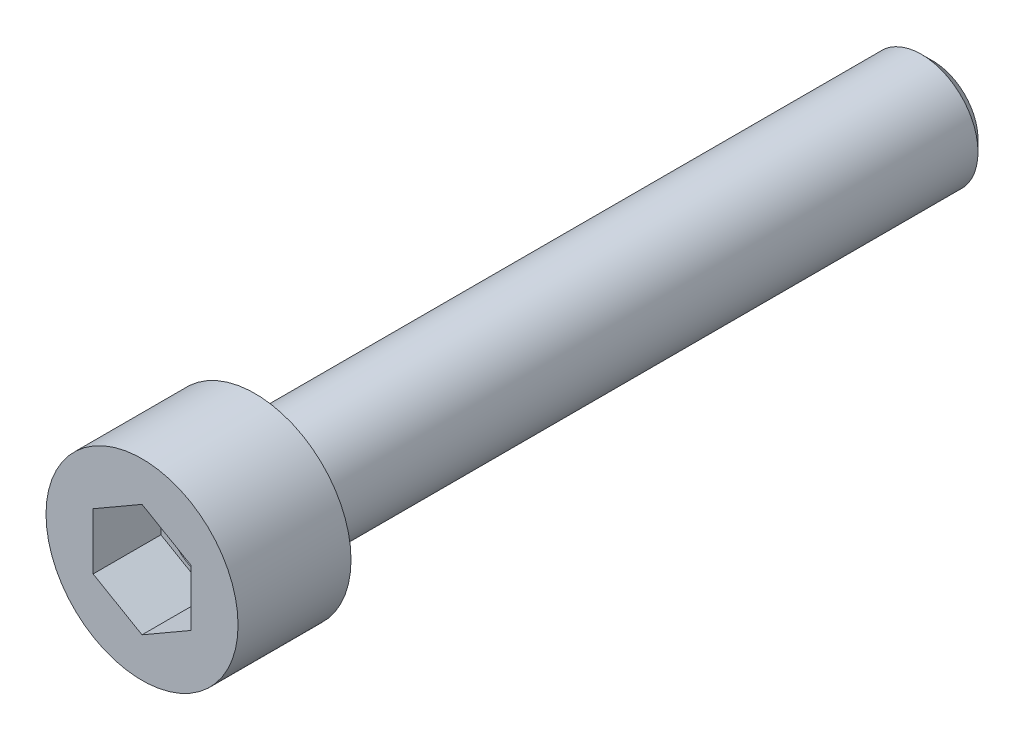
ISO-10303-21;
HEADER;
FILE_DESCRIPTION(('STEP AP214'),'2;1');
FILE_NAME('part.step','',(''),(''),'','','');
FILE_SCHEMA(('AUTOMOTIVE_DESIGN { 1 0 10303 214 1 1 1 1 }'));
ENDSEC;
DATA;
#1=APPLICATION_CONTEXT('core data for automotive mechanical design processes');
#2=APPLICATION_PROTOCOL_DEFINITION('international standard','automotive_design',2000,#1);
#3=PRODUCT_CONTEXT('',#1,'mechanical');
#4=PRODUCT('Part','Part','',(#3));
#5=PRODUCT_RELATED_PRODUCT_CATEGORY('part','',(#4));
#6=PRODUCT_DEFINITION_FORMATION('','',#4);
#7=PRODUCT_DEFINITION_CONTEXT('part definition',#1,'design');
#8=PRODUCT_DEFINITION('design','',#6,#7);
#9=PRODUCT_DEFINITION_SHAPE('','',#8);
#10=(LENGTH_UNIT() NAMED_UNIT(*) SI_UNIT(.MILLI.,.METRE.));
#11=(NAMED_UNIT(*) PLANE_ANGLE_UNIT() SI_UNIT($,.RADIAN.));
#12=(NAMED_UNIT(*) SI_UNIT($,.STERADIAN.) SOLID_ANGLE_UNIT());
#13=UNCERTAINTY_MEASURE_WITH_UNIT(LENGTH_MEASURE(1.E-05),#10,'distance_accuracy_value','');
#14=(GEOMETRIC_REPRESENTATION_CONTEXT(3) GLOBAL_UNCERTAINTY_ASSIGNED_CONTEXT((#13)) GLOBAL_UNIT_ASSIGNED_CONTEXT((#10,
#11,#12)) REPRESENTATION_CONTEXT('',''));
#15=CARTESIAN_POINT('',(0.,0.,0.));
#16=DIRECTION('',(0.,0.,1.));
#17=DIRECTION('',(1.,0.,0.));
#18=AXIS2_PLACEMENT_3D('',#15,#16,#17);
#19=CARTESIAN_POINT('',(0.,0.,-5.));
#20=DIRECTION('',(0.,0.,1.));
#21=DIRECTION('',(1.,0.,0.));
#22=AXIS2_PLACEMENT_3D('',#19,#20,#21);
#23=PLANE('',#22);
#24=CARTESIAN_POINT('',(0.,0.,-5.));
#25=DIRECTION('',(0.,0.,1.));
#26=DIRECTION('',(1.,0.,0.));
#27=AXIS2_PLACEMENT_3D('',#24,#25,#26);
#28=CIRCLE('',#27,4.25);
#29=CARTESIAN_POINT('',(4.25,0.,-5.));
#30=VERTEX_POINT('',#29);
#31=EDGE_CURVE('E147',#30,#30,#28,.T.);
#32=ORIENTED_EDGE('',*,*,#31,.F.);
#33=EDGE_LOOP('',(#32));
#34=FACE_BOUND('',#33,.T.);
#35=CARTESIAN_POINT('',(0.,0.,-5.));
#36=DIRECTION('',(0.,0.,1.));
#37=DIRECTION('',(1.,0.,0.));
#38=AXIS2_PLACEMENT_3D('',#35,#36,#37);
#39=CIRCLE('',#38,2.5);
#40=CARTESIAN_POINT('',(2.5,0.,-5.));
#41=VERTEX_POINT('',#40);
#42=EDGE_CURVE('E150',#41,#41,#39,.F.);
#43=ORIENTED_EDGE('',*,*,#42,.F.);
#44=EDGE_LOOP('',(#43));
#45=FACE_BOUND('',#44,.T.);
#46=ADVANCED_FACE('F28',(#34,#45),#23,.F.);
#47=CARTESIAN_POINT('',(0.,0.,-5.));
#48=DIRECTION('',(0.,0.,1.));
#49=DIRECTION('',(1.,0.,0.));
#50=AXIS2_PLACEMENT_3D('',#47,#48,#49);
#51=CYLINDRICAL_SURFACE('',#50,4.25);
#52=ORIENTED_EDGE('',*,*,#31,.T.);
#53=EDGE_LOOP('',(#52));
#54=FACE_BOUND('',#53,.T.);
#55=CARTESIAN_POINT('',(0.,0.,0.));
#56=DIRECTION('',(0.,0.,1.));
#57=DIRECTION('',(1.,0.,0.));
#58=AXIS2_PLACEMENT_3D('',#55,#56,#57);
#59=CIRCLE('',#58,4.25);
#60=CARTESIAN_POINT('',(4.25,0.,0.));
#61=VERTEX_POINT('',#60);
#62=EDGE_CURVE('E135',#61,#61,#59,.T.);
#63=ORIENTED_EDGE('',*,*,#62,.F.);
#64=EDGE_LOOP('',(#63));
#65=FACE_BOUND('',#64,.T.);
#66=ADVANCED_FACE('F30',(#54,#65),#51,.T.);
#67=CARTESIAN_POINT('',(0.,0.,0.));
#68=DIRECTION('',(0.,0.,1.));
#69=DIRECTION('',(1.,0.,0.));
#70=AXIS2_PLACEMENT_3D('',#67,#68,#69);
#71=PLANE('',#70);
#72=DIRECTION('',(0.866025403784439,-0.5,0.));
#73=VECTOR('',#72,1.);
#74=CARTESIAN_POINT('',(-2.1650635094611,-1.25,0.));
#75=LINE('',#74,#73);
#76=CARTESIAN_POINT('',(-2.1650635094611,-1.25,0.));
#77=VERTEX_POINT('',#76);
#78=CARTESIAN_POINT('',(0.,-2.5,0.));
#79=VERTEX_POINT('',#78);
#80=EDGE_CURVE('E43',#77,#79,#75,.T.);
#81=ORIENTED_EDGE('',*,*,#80,.F.);
#82=DIRECTION('',(0.,-1.,0.));
#83=VECTOR('',#82,1.);
#84=CARTESIAN_POINT('',(-2.1650635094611,1.25,0.));
#85=LINE('',#84,#83);
#86=CARTESIAN_POINT('',(-2.1650635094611,1.25,0.));
#87=VERTEX_POINT('',#86);
#88=EDGE_CURVE('E113',#87,#77,#85,.T.);
#89=ORIENTED_EDGE('',*,*,#88,.F.);
#90=DIRECTION('',(-0.866025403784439,-0.5,0.));
#91=VECTOR('',#90,1.);
#92=CARTESIAN_POINT('',(0.,2.5,0.));
#93=LINE('',#92,#91);
#94=CARTESIAN_POINT('',(0.,2.5,0.));
#95=VERTEX_POINT('',#94);
#96=EDGE_CURVE('E110',#95,#87,#93,.T.);
#97=ORIENTED_EDGE('',*,*,#96,.F.);
#98=DIRECTION('',(-0.866025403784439,0.5,0.));
#99=VECTOR('',#98,1.);
#100=CARTESIAN_POINT('',(2.1650635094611,1.25,0.));
#101=LINE('',#100,#99);
#102=CARTESIAN_POINT('',(2.1650635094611,1.25,0.));
#103=VERTEX_POINT('',#102);
#104=EDGE_CURVE('E107',#103,#95,#101,.T.);
#105=ORIENTED_EDGE('',*,*,#104,.F.);
#106=DIRECTION('',(0.,1.,0.));
#107=VECTOR('',#106,1.);
#108=CARTESIAN_POINT('',(2.1650635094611,-1.25,0.));
#109=LINE('',#108,#107);
#110=CARTESIAN_POINT('',(2.1650635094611,-1.25,0.));
#111=VERTEX_POINT('',#110);
#112=EDGE_CURVE('E104',#111,#103,#109,.T.);
#113=ORIENTED_EDGE('',*,*,#112,.F.);
#114=DIRECTION('',(0.866025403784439,0.5,0.));
#115=VECTOR('',#114,1.);
#116=CARTESIAN_POINT('',(0.,-2.5,0.));
#117=LINE('',#116,#115);
#118=EDGE_CURVE('E95',#79,#111,#117,.T.);
#119=ORIENTED_EDGE('',*,*,#118,.F.);
#120=EDGE_LOOP('',(#81,#89,#97,#105,#113,#119));
#121=FACE_BOUND('',#120,.T.);
#122=ORIENTED_EDGE('',*,*,#62,.T.);
#123=EDGE_LOOP('',(#122));
#124=FACE_BOUND('',#123,.T.);
#125=ADVANCED_FACE('F174',(#121,#124),#71,.T.);
#126=CARTESIAN_POINT('',(0.,0.,-35.));
#127=DIRECTION('',(0.,0.,1.));
#128=DIRECTION('',(1.,0.,0.));
#129=AXIS2_PLACEMENT_3D('',#126,#127,#128);
#130=CYLINDRICAL_SURFACE('',#129,2.5);
#131=CARTESIAN_POINT('',(0.,0.,-34.5));
#132=DIRECTION('',(0.,0.,-1.));
#133=DIRECTION('',(-1.,0.,0.));
#134=AXIS2_PLACEMENT_3D('',#131,#132,#133);
#135=CIRCLE('',#134,2.5);
#136=CARTESIAN_POINT('',(-2.5,0.,-34.5));
#137=VERTEX_POINT('',#136);
#138=EDGE_CURVE('E11',#137,#137,#135,.F.);
#139=ORIENTED_EDGE('',*,*,#138,.T.);
#140=EDGE_LOOP('',(#139));
#141=FACE_BOUND('',#140,.T.);
#142=ORIENTED_EDGE('',*,*,#42,.T.);
#143=EDGE_LOOP('',(#142));
#144=FACE_BOUND('',#143,.T.);
#145=ADVANCED_FACE('F181',(#141,#144),#130,.T.);
#146=CARTESIAN_POINT('',(0.,0.,-35.));
#147=DIRECTION('',(0.,0.,-1.));
#148=DIRECTION('',(-1.,0.,0.));
#149=AXIS2_PLACEMENT_3D('',#146,#147,#148);
#150=PLANE('',#149);
#151=CARTESIAN_POINT('',(0.,0.,-35.));
#152=DIRECTION('',(0.,0.,-1.));
#153=DIRECTION('',(-1.,0.,0.));
#154=AXIS2_PLACEMENT_3D('',#151,#152,#153);
#155=CIRCLE('',#154,2.);
#156=CARTESIAN_POINT('',(-2.,0.,-35.));
#157=VERTEX_POINT('',#156);
#158=EDGE_CURVE('E36',#157,#157,#155,.T.);
#159=ORIENTED_EDGE('',*,*,#158,.T.);
#160=EDGE_LOOP('',(#159));
#161=FACE_BOUND('',#160,.T.);
#162=ADVANCED_FACE('F155',(#161),#150,.T.);
#163=CARTESIAN_POINT('',(-2.1650635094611,-1.25,-3.));
#164=DIRECTION('',(-0.5,-0.866025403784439,0.));
#165=DIRECTION('',(0.866025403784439,-0.5,0.));
#166=AXIS2_PLACEMENT_3D('',#163,#164,#165);
#167=PLANE('',#166);
#168=ORIENTED_EDGE('',*,*,#80,.T.);
#169=DIRECTION('',(0.,0.,1.));
#170=VECTOR('',#169,1.);
#171=CARTESIAN_POINT('',(0.,-2.5,-3.));
#172=LINE('',#171,#170);
#173=CARTESIAN_POINT('',(0.,-2.5,-3.));
#174=VERTEX_POINT('',#173);
#175=EDGE_CURVE('E133',#174,#79,#172,.T.);
#176=ORIENTED_EDGE('',*,*,#175,.F.);
#177=DIRECTION('',(0.866025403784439,-0.5,0.));
#178=VECTOR('',#177,1.);
#179=CARTESIAN_POINT('',(-2.1650635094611,-1.25,-3.));
#180=LINE('',#179,#178);
#181=CARTESIAN_POINT('',(-2.1650635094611,-1.25,-3.));
#182=VERTEX_POINT('',#181);
#183=EDGE_CURVE('E115',#182,#174,#180,.T.);
#184=ORIENTED_EDGE('',*,*,#183,.F.);
#185=DIRECTION('',(0.,0.,1.));
#186=VECTOR('',#185,1.);
#187=CARTESIAN_POINT('',(-2.1650635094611,-1.25,-3.));
#188=LINE('',#187,#186);
#189=EDGE_CURVE('E50',#182,#77,#188,.T.);
#190=ORIENTED_EDGE('',*,*,#189,.T.);
#191=EDGE_LOOP('',(#168,#176,#184,#190));
#192=FACE_BOUND('',#191,.T.);
#193=ADVANCED_FACE('F188',(#192),#167,.F.);
#194=CARTESIAN_POINT('',(-2.1650635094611,1.25,-3.));
#195=DIRECTION('',(-1.,0.,0.));
#196=DIRECTION('',(0.,-1.,0.));
#197=AXIS2_PLACEMENT_3D('',#194,#195,#196);
#198=PLANE('',#197);
#199=ORIENTED_EDGE('',*,*,#88,.T.);
#200=ORIENTED_EDGE('',*,*,#189,.F.);
#201=DIRECTION('',(0.,-1.,0.));
#202=VECTOR('',#201,1.);
#203=CARTESIAN_POINT('',(-2.1650635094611,1.25,-3.));
#204=LINE('',#203,#202);
#205=CARTESIAN_POINT('',(-2.1650635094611,1.25,-3.));
#206=VERTEX_POINT('',#205);
#207=EDGE_CURVE('E130',#206,#182,#204,.T.);
#208=ORIENTED_EDGE('',*,*,#207,.F.);
#209=DIRECTION('',(0.,0.,1.));
#210=VECTOR('',#209,1.);
#211=CARTESIAN_POINT('',(-2.1650635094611,1.25,-3.));
#212=LINE('',#211,#210);
#213=EDGE_CURVE('E136',#206,#87,#212,.T.);
#214=ORIENTED_EDGE('',*,*,#213,.T.);
#215=EDGE_LOOP('',(#199,#200,#208,#214));
#216=FACE_BOUND('',#215,.T.);
#217=ADVANCED_FACE('F191',(#216),#198,.F.);
#218=CARTESIAN_POINT('',(0.,2.5,-3.));
#219=DIRECTION('',(-0.5,0.866025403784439,0.));
#220=DIRECTION('',(-0.866025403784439,-0.5,0.));
#221=AXIS2_PLACEMENT_3D('',#218,#219,#220);
#222=PLANE('',#221);
#223=ORIENTED_EDGE('',*,*,#96,.T.);
#224=ORIENTED_EDGE('',*,*,#213,.F.);
#225=DIRECTION('',(-0.866025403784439,-0.5,0.));
#226=VECTOR('',#225,1.);
#227=CARTESIAN_POINT('',(0.,2.5,-3.));
#228=LINE('',#227,#226);
#229=CARTESIAN_POINT('',(0.,2.5,-3.));
#230=VERTEX_POINT('',#229);
#231=EDGE_CURVE('E127',#230,#206,#228,.T.);
#232=ORIENTED_EDGE('',*,*,#231,.F.);
#233=DIRECTION('',(0.,0.,1.));
#234=VECTOR('',#233,1.);
#235=CARTESIAN_POINT('',(0.,2.5,-3.));
#236=LINE('',#235,#234);
#237=EDGE_CURVE('E138',#230,#95,#236,.T.);
#238=ORIENTED_EDGE('',*,*,#237,.T.);
#239=EDGE_LOOP('',(#223,#224,#232,#238));
#240=FACE_BOUND('',#239,.T.);
#241=ADVANCED_FACE('F203',(#240),#222,.F.);
#242=CARTESIAN_POINT('',(2.1650635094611,1.25,-3.));
#243=DIRECTION('',(0.5,0.866025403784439,0.));
#244=DIRECTION('',(-0.866025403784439,0.5,0.));
#245=AXIS2_PLACEMENT_3D('',#242,#243,#244);
#246=PLANE('',#245);
#247=ORIENTED_EDGE('',*,*,#104,.T.);
#248=ORIENTED_EDGE('',*,*,#237,.F.);
#249=DIRECTION('',(-0.866025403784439,0.5,0.));
#250=VECTOR('',#249,1.);
#251=CARTESIAN_POINT('',(2.1650635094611,1.25,-3.));
#252=LINE('',#251,#250);
#253=CARTESIAN_POINT('',(2.1650635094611,1.25,-3.));
#254=VERTEX_POINT('',#253);
#255=EDGE_CURVE('E124',#254,#230,#252,.T.);
#256=ORIENTED_EDGE('',*,*,#255,.F.);
#257=DIRECTION('',(0.,0.,1.));
#258=VECTOR('',#257,1.);
#259=CARTESIAN_POINT('',(2.1650635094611,1.25,-3.));
#260=LINE('',#259,#258);
#261=EDGE_CURVE('E140',#254,#103,#260,.T.);
#262=ORIENTED_EDGE('',*,*,#261,.T.);
#263=EDGE_LOOP('',(#247,#248,#256,#262));
#264=FACE_BOUND('',#263,.T.);
#265=ADVANCED_FACE('F199',(#264),#246,.F.);
#266=CARTESIAN_POINT('',(2.1650635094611,-1.25,-3.));
#267=DIRECTION('',(1.,0.,0.));
#268=DIRECTION('',(0.,1.,0.));
#269=AXIS2_PLACEMENT_3D('',#266,#267,#268);
#270=PLANE('',#269);
#271=ORIENTED_EDGE('',*,*,#112,.T.);
#272=ORIENTED_EDGE('',*,*,#261,.F.);
#273=DIRECTION('',(0.,1.,0.));
#274=VECTOR('',#273,1.);
#275=CARTESIAN_POINT('',(2.1650635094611,-1.25,-3.));
#276=LINE('',#275,#274);
#277=CARTESIAN_POINT('',(2.1650635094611,-1.25,-3.));
#278=VERTEX_POINT('',#277);
#279=EDGE_CURVE('E121',#278,#254,#276,.T.);
#280=ORIENTED_EDGE('',*,*,#279,.F.);
#281=DIRECTION('',(0.,0.,1.));
#282=VECTOR('',#281,1.);
#283=CARTESIAN_POINT('',(2.1650635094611,-1.25,-3.));
#284=LINE('',#283,#282);
#285=EDGE_CURVE('E142',#278,#111,#284,.T.);
#286=ORIENTED_EDGE('',*,*,#285,.T.);
#287=EDGE_LOOP('',(#271,#272,#280,#286));
#288=FACE_BOUND('',#287,.T.);
#289=ADVANCED_FACE('F195',(#288),#270,.F.);
#290=CARTESIAN_POINT('',(0.,-2.5,-3.));
#291=DIRECTION('',(0.5,-0.866025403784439,0.));
#292=DIRECTION('',(0.866025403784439,0.5,0.));
#293=AXIS2_PLACEMENT_3D('',#290,#291,#292);
#294=PLANE('',#293);
#295=ORIENTED_EDGE('',*,*,#118,.T.);
#296=ORIENTED_EDGE('',*,*,#285,.F.);
#297=DIRECTION('',(0.866025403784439,0.5,0.));
#298=VECTOR('',#297,1.);
#299=CARTESIAN_POINT('',(0.,-2.5,-3.));
#300=LINE('',#299,#298);
#301=EDGE_CURVE('E118',#174,#278,#300,.T.);
#302=ORIENTED_EDGE('',*,*,#301,.F.);
#303=ORIENTED_EDGE('',*,*,#175,.T.);
#304=EDGE_LOOP('',(#295,#296,#302,#303));
#305=FACE_BOUND('',#304,.T.);
#306=ADVANCED_FACE('F192',(#305),#294,.F.);
#307=CARTESIAN_POINT('',(2.1650635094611,-3.75,-3.));
#308=DIRECTION('',(0.,0.,1.));
#309=DIRECTION('',(1.,0.,0.));
#310=AXIS2_PLACEMENT_3D('',#307,#308,#309);
#311=PLANE('',#310);
#312=CARTESIAN_POINT('',(0.,0.,-3.));
#313=DIRECTION('',(0.,0.,1.));
#314=DIRECTION('',(1.,0.,0.));
#315=AXIS2_PLACEMENT_3D('',#312,#313,#314);
#316=CIRCLE('',#315,2.);
#317=CARTESIAN_POINT('',(2.,0.,-3.));
#318=VERTEX_POINT('',#317);
#319=EDGE_CURVE('E223',#318,#318,#316,.T.);
#320=ORIENTED_EDGE('',*,*,#319,.F.);
#321=EDGE_LOOP('',(#320));
#322=FACE_BOUND('',#321,.T.);
#323=ORIENTED_EDGE('',*,*,#183,.T.);
#324=ORIENTED_EDGE('',*,*,#301,.T.);
#325=ORIENTED_EDGE('',*,*,#279,.T.);
#326=ORIENTED_EDGE('',*,*,#255,.T.);
#327=ORIENTED_EDGE('',*,*,#231,.T.);
#328=ORIENTED_EDGE('',*,*,#207,.T.);
#329=EDGE_LOOP('',(#323,#324,#325,#326,#327,#328));
#330=FACE_BOUND('',#329,.T.);
#331=ADVANCED_FACE('F87',(#322,#330),#311,.T.);
#332=CARTESIAN_POINT('',(0.,0.,-3.0002));
#333=DIRECTION('',(0.,0.,1.));
#334=DIRECTION('',(1.,0.,0.));
#335=AXIS2_PLACEMENT_3D('',#332,#333,#334);
#336=CONICAL_SURFACE('',#335,2.5999948,1.02974425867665);
#337=CARTESIAN_POINT('',(0.,0.,-4.56243448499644));
#338=VERTEX_POINT('',#337);
#339=VERTEX_LOOP('',#338);
#340=FACE_BOUND('',#339,.T.);
#341=CARTESIAN_POINT('',(0.,0.,-3.0002));
#342=DIRECTION('',(0.,0.,1.));
#343=DIRECTION('',(1.,0.,0.));
#344=AXIS2_PLACEMENT_3D('',#341,#342,#343);
#345=CIRCLE('',#344,2.5999948);
#346=CARTESIAN_POINT('',(2.5999948,0.,-3.0002));
#347=VERTEX_POINT('',#346);
#348=EDGE_CURVE('E91',#347,#347,#345,.T.);
#349=ORIENTED_EDGE('',*,*,#348,.T.);
#350=EDGE_LOOP('',(#349));
#351=FACE_BOUND('',#350,.T.);
#352=ADVANCED_FACE('F83',(#340,#351),#336,.F.);
#353=CARTESIAN_POINT('',(0.,0.,-3.));
#354=DIRECTION('',(0.,0.,1.));
#355=DIRECTION('',(1.,0.,0.));
#356=AXIS2_PLACEMENT_3D('',#353,#354,#355);
#357=CYLINDRICAL_SURFACE('',#356,2.5999948);
#358=ORIENTED_EDGE('',*,*,#348,.F.);
#359=EDGE_LOOP('',(#358));
#360=FACE_BOUND('',#359,.T.);
#361=CARTESIAN_POINT('',(0.,0.,-3.0001));
#362=DIRECTION('',(0.,0.,1.));
#363=DIRECTION('',(1.,0.,0.));
#364=AXIS2_PLACEMENT_3D('',#361,#362,#363);
#365=CIRCLE('',#364,2.59999480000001);
#366=CARTESIAN_POINT('',(2.59999480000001,0.,-3.0001));
#367=VERTEX_POINT('',#366);
#368=EDGE_CURVE('E93',#367,#367,#365,.T.);
#369=ORIENTED_EDGE('',*,*,#368,.T.);
#370=EDGE_LOOP('',(#369));
#371=FACE_BOUND('',#370,.T.);
#372=ADVANCED_FACE('F86',(#360,#371),#357,.F.);
#373=CARTESIAN_POINT('',(2.59999480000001,0.,-3.0001));
#374=DIRECTION('',(0.,0.,1.));
#375=DIRECTION('',(1.,0.,0.));
#376=AXIS2_PLACEMENT_3D('',#373,#374,#375);
#377=PLANE('',#376);
#378=ORIENTED_EDGE('',*,*,#368,.F.);
#379=EDGE_LOOP('',(#378));
#380=FACE_BOUND('',#379,.T.);
#381=CARTESIAN_POINT('',(0.,0.,-3.0001));
#382=DIRECTION('',(0.,0.,1.));
#383=DIRECTION('',(1.,0.,0.));
#384=AXIS2_PLACEMENT_3D('',#381,#382,#383);
#385=CIRCLE('',#384,1.99999700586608);
#386=CARTESIAN_POINT('',(1.99999700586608,0.,-3.0001));
#387=VERTEX_POINT('',#386);
#388=EDGE_CURVE('E98',#387,#387,#385,.T.);
#389=ORIENTED_EDGE('',*,*,#388,.T.);
#390=EDGE_LOOP('',(#389));
#391=FACE_BOUND('',#390,.T.);
#392=ADVANCED_FACE('F165',(#380,#391),#377,.F.);
#393=CARTESIAN_POINT('',(0.,0.,-3.));
#394=DIRECTION('',(0.,0.,1.));
#395=DIRECTION('',(1.,0.,0.));
#396=AXIS2_PLACEMENT_3D('',#393,#394,#395);
#397=CYLINDRICAL_SURFACE('',#396,1.99999850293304);
#398=ORIENTED_EDGE('',*,*,#388,.F.);
#399=EDGE_LOOP('',(#398));
#400=FACE_BOUND('',#399,.T.);
#401=ORIENTED_EDGE('',*,*,#319,.T.);
#402=EDGE_LOOP('',(#401));
#403=FACE_BOUND('',#402,.T.);
#404=ADVANCED_FACE('F159',(#400,#403),#397,.F.);
#405=CARTESIAN_POINT('',(0.,0.,-35.));
#406=DIRECTION('',(0.,0.,1.));
#407=DIRECTION('',(1.,0.,0.));
#408=AXIS2_PLACEMENT_3D('',#405,#406,#407);
#409=CONICAL_SURFACE('',#408,2.,0.785398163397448);
#410=ORIENTED_EDGE('',*,*,#138,.F.);
#411=EDGE_LOOP('',(#410));
#412=FACE_BOUND('',#411,.T.);
#413=ORIENTED_EDGE('',*,*,#158,.F.);
#414=EDGE_LOOP('',(#413));
#415=FACE_BOUND('',#414,.T.);
#416=ADVANCED_FACE('F157',(#412,#415),#409,.T.);
#417=CLOSED_SHELL('',(#46,#66,#125,#145,#162,#193,#217,#241,#265,#289,#306,#331,#352,#372,#392,
#404,#416));
#418=MANIFOLD_SOLID_BREP('B2',#417);
#419=ADVANCED_BREP_SHAPE_REPRESENTATION('',(#18,#418),#14);
#420=SHAPE_DEFINITION_REPRESENTATION(#9,#419);
ENDSEC;
END-ISO-10303-21;
